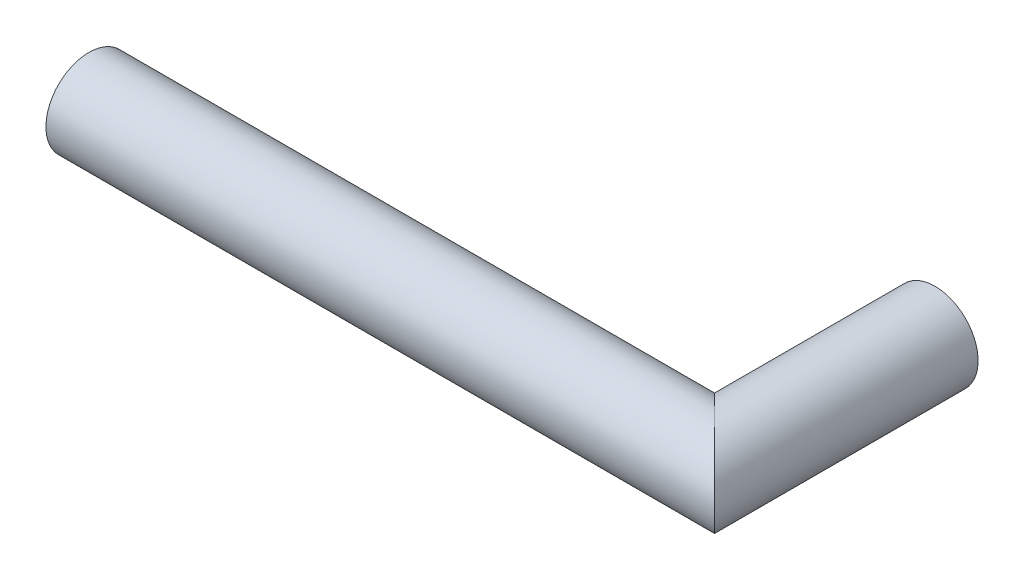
ISO-10303-21;
HEADER;
FILE_DESCRIPTION(('STEP AP214'),'2;1');
FILE_NAME('part.step','',(''),(''),'','','');
FILE_SCHEMA(('AUTOMOTIVE_DESIGN { 1 0 10303 214 1 1 1 1 }'));
ENDSEC;
DATA;
#1=APPLICATION_CONTEXT('core data for automotive mechanical design processes');
#2=APPLICATION_PROTOCOL_DEFINITION('international standard','automotive_design',2000,#1);
#3=PRODUCT_CONTEXT('',#1,'mechanical');
#4=PRODUCT('Part','Part','',(#3));
#5=PRODUCT_RELATED_PRODUCT_CATEGORY('part','',(#4));
#6=PRODUCT_DEFINITION_FORMATION('','',#4);
#7=PRODUCT_DEFINITION_CONTEXT('part definition',#1,'design');
#8=PRODUCT_DEFINITION('design','',#6,#7);
#9=PRODUCT_DEFINITION_SHAPE('','',#8);
#10=(LENGTH_UNIT() NAMED_UNIT(*) SI_UNIT(.MILLI.,.METRE.));
#11=(NAMED_UNIT(*) PLANE_ANGLE_UNIT() SI_UNIT($,.RADIAN.));
#12=(NAMED_UNIT(*) SI_UNIT($,.STERADIAN.) SOLID_ANGLE_UNIT());
#13=UNCERTAINTY_MEASURE_WITH_UNIT(LENGTH_MEASURE(1.E-05),#10,'distance_accuracy_value','');
#14=(GEOMETRIC_REPRESENTATION_CONTEXT(3) GLOBAL_UNCERTAINTY_ASSIGNED_CONTEXT((#13)) GLOBAL_UNIT_ASSIGNED_CONTEXT((#10,
#11,#12)) REPRESENTATION_CONTEXT('',''));
#15=CARTESIAN_POINT('',(0.,0.,0.));
#16=DIRECTION('',(0.,0.,1.));
#17=DIRECTION('',(1.,0.,0.));
#18=AXIS2_PLACEMENT_3D('',#15,#16,#17);
#19=CARTESIAN_POINT('',(87.25,0.,6.69999999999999));
#20=DIRECTION('',(0.,0.,-1.));
#21=DIRECTION('',(-1.,0.,0.));
#22=AXIS2_PLACEMENT_3D('',#19,#20,#21);
#23=CYLINDRICAL_SURFACE('',#22,6.);
#24=CARTESIAN_POINT('',(87.25,0.,0.));
#25=DIRECTION('',(0.707106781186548,0.,-0.707106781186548));
#26=DIRECTION('',(0.707106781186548,0.,0.707106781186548));
#27=AXIS2_PLACEMENT_3D('',#24,#25,#26);
#28=ELLIPSE('',#27,8.48528137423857,6.);
#29=CARTESIAN_POINT('',(93.25,0.,6.));
#30=VERTEX_POINT('',#29);
#31=EDGE_CURVE('E37',#30,#30,#28,.F.);
#32=ORIENTED_EDGE('',*,*,#31,.F.);
#33=EDGE_LOOP('',(#32));
#34=FACE_BOUND('',#33,.T.);
#35=CARTESIAN_POINT('',(87.25,0.,-30.7513203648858));
#36=DIRECTION('',(0.,0.,-1.));
#37=DIRECTION('',(-1.,0.,0.));
#38=AXIS2_PLACEMENT_3D('',#35,#36,#37);
#39=CIRCLE('',#38,6.);
#40=CARTESIAN_POINT('',(81.25,0.,-30.7513203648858));
#41=VERTEX_POINT('',#40);
#42=EDGE_CURVE('E48',#41,#41,#39,.T.);
#43=ORIENTED_EDGE('',*,*,#42,.F.);
#44=EDGE_LOOP('',(#43));
#45=FACE_BOUND('',#44,.T.);
#46=ADVANCED_FACE('F34',(#34,#45),#23,.T.);
#47=CARTESIAN_POINT('',(0.,0.,0.));
#48=DIRECTION('',(1.,0.,0.));
#49=DIRECTION('',(0.,0.,-1.));
#50=AXIS2_PLACEMENT_3D('',#47,#48,#49);
#51=CYLINDRICAL_SURFACE('',#50,6.);
#52=CARTESIAN_POINT('',(0.,0.,0.));
#53=DIRECTION('',(1.,0.,0.));
#54=DIRECTION('',(0.,0.,-1.));
#55=AXIS2_PLACEMENT_3D('',#52,#53,#54);
#56=CIRCLE('',#55,6.);
#57=CARTESIAN_POINT('',(0.,0.,-6.));
#58=VERTEX_POINT('',#57);
#59=EDGE_CURVE('E54',#58,#58,#56,.T.);
#60=ORIENTED_EDGE('',*,*,#59,.T.);
#61=EDGE_LOOP('',(#60));
#62=FACE_BOUND('',#61,.T.);
#63=ORIENTED_EDGE('',*,*,#31,.T.);
#64=EDGE_LOOP('',(#63));
#65=FACE_BOUND('',#64,.T.);
#66=ADVANCED_FACE('F79',(#62,#65),#51,.T.);
#67=CARTESIAN_POINT('',(87.25,0.,-30.7513203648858));
#68=DIRECTION('',(0.,0.,-1.));
#69=DIRECTION('',(-1.,0.,0.));
#70=AXIS2_PLACEMENT_3D('',#67,#68,#69);
#71=PLANE('',#70);
#72=CARTESIAN_POINT('',(87.25,0.,-30.7513203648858));
#73=DIRECTION('',(0.,0.,-1.));
#74=DIRECTION('',(-1.,0.,0.));
#75=AXIS2_PLACEMENT_3D('',#72,#73,#74);
#76=CIRCLE('',#75,5.);
#77=CARTESIAN_POINT('',(82.25,0.,-30.7513203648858));
#78=VERTEX_POINT('',#77);
#79=EDGE_CURVE('E73',#78,#78,#76,.F.);
#80=ORIENTED_EDGE('',*,*,#79,.T.);
#81=EDGE_LOOP('',(#80));
#82=FACE_BOUND('',#81,.T.);
#83=ORIENTED_EDGE('',*,*,#42,.T.);
#84=EDGE_LOOP('',(#83));
#85=FACE_BOUND('',#84,.T.);
#86=ADVANCED_FACE('F81',(#82,#85),#71,.T.);
#87=CARTESIAN_POINT('',(0.,0.,0.));
#88=DIRECTION('',(1.,0.,0.));
#89=DIRECTION('',(0.,0.,-1.));
#90=AXIS2_PLACEMENT_3D('',#87,#88,#89);
#91=PLANE('',#90);
#92=CARTESIAN_POINT('',(0.,0.,0.));
#93=DIRECTION('',(1.,0.,0.));
#94=DIRECTION('',(0.,0.,-1.));
#95=AXIS2_PLACEMENT_3D('',#92,#93,#94);
#96=CIRCLE('',#95,5.);
#97=CARTESIAN_POINT('',(0.,0.,-5.));
#98=VERTEX_POINT('',#97);
#99=EDGE_CURVE('E42',#98,#98,#96,.F.);
#100=ORIENTED_EDGE('',*,*,#99,.F.);
#101=EDGE_LOOP('',(#100));
#102=FACE_BOUND('',#101,.T.);
#103=ORIENTED_EDGE('',*,*,#59,.F.);
#104=EDGE_LOOP('',(#103));
#105=FACE_BOUND('',#104,.T.);
#106=ADVANCED_FACE('F70',(#102,#105),#91,.F.);
#107=CARTESIAN_POINT('',(87.25,0.,5.59999999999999));
#108=DIRECTION('',(0.,0.,-1.));
#109=DIRECTION('',(-1.,0.,0.));
#110=AXIS2_PLACEMENT_3D('',#107,#108,#109);
#111=CYLINDRICAL_SURFACE('',#110,5.);
#112=CARTESIAN_POINT('',(87.25,0.,0.));
#113=DIRECTION('',(0.707106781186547,0.,-0.707106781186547));
#114=DIRECTION('',(0.707106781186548,0.,0.707106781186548));
#115=AXIS2_PLACEMENT_3D('',#112,#113,#114);
#116=ELLIPSE('',#115,7.07106781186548,5.);
#117=CARTESIAN_POINT('',(92.25,0.,5.));
#118=VERTEX_POINT('',#117);
#119=EDGE_CURVE('E11',#118,#118,#116,.T.);
#120=ORIENTED_EDGE('',*,*,#119,.F.);
#121=EDGE_LOOP('',(#120));
#122=FACE_BOUND('',#121,.T.);
#123=ORIENTED_EDGE('',*,*,#79,.F.);
#124=EDGE_LOOP('',(#123));
#125=FACE_BOUND('',#124,.T.);
#126=ADVANCED_FACE('F90',(#122,#125),#111,.F.);
#127=CARTESIAN_POINT('',(0.,0.,0.));
#128=DIRECTION('',(1.,0.,0.));
#129=DIRECTION('',(0.,0.,-1.));
#130=AXIS2_PLACEMENT_3D('',#127,#128,#129);
#131=CYLINDRICAL_SURFACE('',#130,5.);
#132=ORIENTED_EDGE('',*,*,#99,.T.);
#133=EDGE_LOOP('',(#132));
#134=FACE_BOUND('',#133,.T.);
#135=ORIENTED_EDGE('',*,*,#119,.T.);
#136=EDGE_LOOP('',(#135));
#137=FACE_BOUND('',#136,.T.);
#138=ADVANCED_FACE('F88',(#134,#137),#131,.F.);
#139=CLOSED_SHELL('',(#46,#66,#86,#106,#126,#138));
#140=MANIFOLD_SOLID_BREP('B2',#139);
#141=ADVANCED_BREP_SHAPE_REPRESENTATION('',(#18,#140),#14);
#142=SHAPE_DEFINITION_REPRESENTATION(#9,#141);
ENDSEC;
END-ISO-10303-21;
